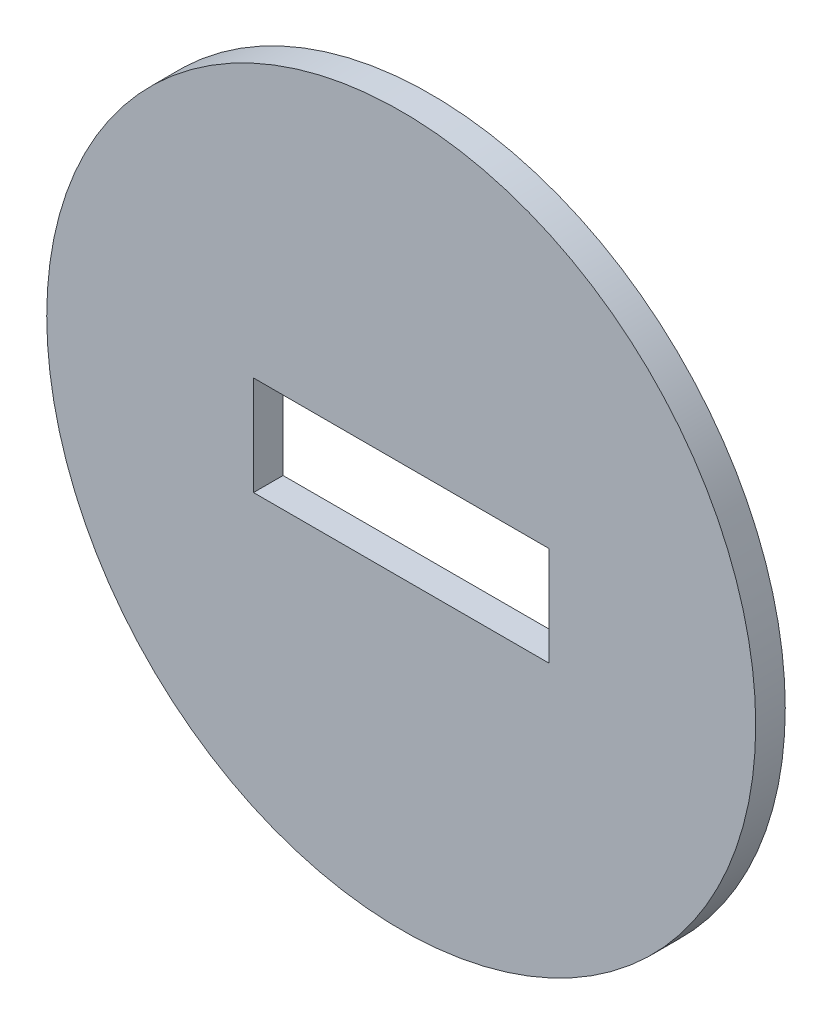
from build123d import *

# Parameters (mm, degrees)
SKETCH1_R          = 38.1
EXTRUDE1_DEPTH     = 3.175
SKETCH2_W          = 31.75
SKETCH2_H          = 10.668
CUT_EXTRUDE1_DEPTH = 54.975


with BuildPart() as part:
    # Sketch1 → Extrude1 (new body)
    with BuildSketch(Plane.XY):
        Circle(SKETCH1_R)
    extrude(amount=EXTRUDE1_DEPTH)

    # Sketch2 → Cut-Extrude1 (cut, through all)
    with BuildSketch(Plane.XY.offset(3.175)):
        Rectangle(SKETCH2_W, SKETCH2_H)
    extrude(amount=-CUT_EXTRUDE1_DEPTH, mode=Mode.SUBTRACT)


solid = part.part
